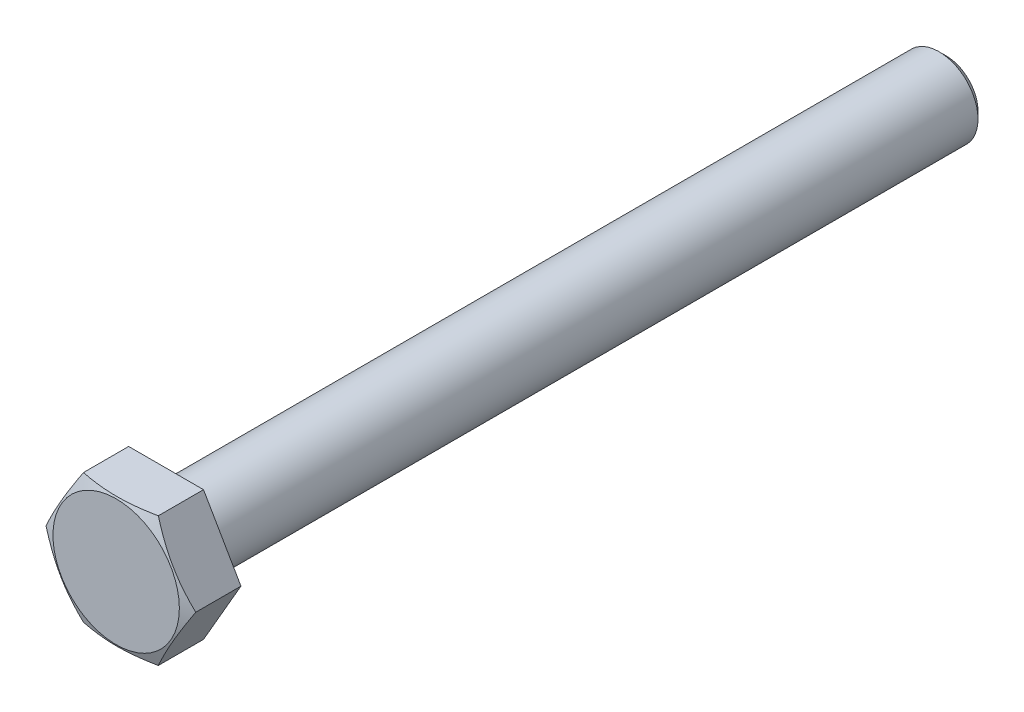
ISO-10303-21;
HEADER;
FILE_DESCRIPTION(('STEP AP214'),'2;1');
FILE_NAME('part.step','',(''),(''),'','','');
FILE_SCHEMA(('AUTOMOTIVE_DESIGN { 1 0 10303 214 1 1 1 1 }'));
ENDSEC;
DATA;
#1=APPLICATION_CONTEXT('core data for automotive mechanical design processes');
#2=APPLICATION_PROTOCOL_DEFINITION('international standard','automotive_design',2000,#1);
#3=PRODUCT_CONTEXT('',#1,'mechanical');
#4=PRODUCT('Part','Part','',(#3));
#5=PRODUCT_RELATED_PRODUCT_CATEGORY('part','',(#4));
#6=PRODUCT_DEFINITION_FORMATION('','',#4);
#7=PRODUCT_DEFINITION_CONTEXT('part definition',#1,'design');
#8=PRODUCT_DEFINITION('design','',#6,#7);
#9=PRODUCT_DEFINITION_SHAPE('','',#8);
#10=(LENGTH_UNIT() NAMED_UNIT(*) SI_UNIT(.MILLI.,.METRE.));
#11=(NAMED_UNIT(*) PLANE_ANGLE_UNIT() SI_UNIT($,.RADIAN.));
#12=(NAMED_UNIT(*) SI_UNIT($,.STERADIAN.) SOLID_ANGLE_UNIT());
#13=UNCERTAINTY_MEASURE_WITH_UNIT(LENGTH_MEASURE(1.E-05),#10,'distance_accuracy_value','');
#14=(GEOMETRIC_REPRESENTATION_CONTEXT(3) GLOBAL_UNCERTAINTY_ASSIGNED_CONTEXT((#13)) GLOBAL_UNIT_ASSIGNED_CONTEXT((#10,
#11,#12)) REPRESENTATION_CONTEXT('',''));
#15=CARTESIAN_POINT('',(0.,0.,0.));
#16=DIRECTION('',(0.,0.,1.));
#17=DIRECTION('',(1.,0.,0.));
#18=AXIS2_PLACEMENT_3D('',#15,#16,#17);
#19=CARTESIAN_POINT('',(0.,4.6,0.15));
#20=DIRECTION('',(0.,0.,1.));
#21=DIRECTION('',(1.,0.,0.));
#22=AXIS2_PLACEMENT_3D('',#19,#20,#21);
#23=PLANE('',#22);
#24=CARTESIAN_POINT('',(0.,0.,0.15));
#25=DIRECTION('',(0.,0.,1.));
#26=DIRECTION('',(1.,0.,0.));
#27=AXIS2_PLACEMENT_3D('',#24,#25,#26);
#28=CIRCLE('',#27,4.6);
#29=CARTESIAN_POINT('',(4.6,0.,0.15));
#30=VERTEX_POINT('',#29);
#31=EDGE_CURVE('E237',#30,#30,#28,.T.);
#32=ORIENTED_EDGE('',*,*,#31,.T.);
#33=EDGE_LOOP('',(#32));
#34=FACE_BOUND('',#33,.T.);
#35=DIRECTION('',(-1.,0.,0.));
#36=VECTOR('',#35,1.);
#37=CARTESIAN_POINT('',(0.,-4.99999766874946,0.15));
#38=LINE('',#37,#36);
#39=CARTESIAN_POINT('',(2.88675,-4.99999766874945,0.149999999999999));
#40=VERTEX_POINT('',#39);
#41=CARTESIAN_POINT('',(-2.88675,-4.99999766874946,0.15));
#42=VERTEX_POINT('',#41);
#43=EDGE_CURVE('E223',#40,#42,#38,.T.);
#44=ORIENTED_EDGE('',*,*,#43,.T.);
#45=DIRECTION('',(-0.5,0.866025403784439,0.));
#46=VECTOR('',#45,1.);
#47=CARTESIAN_POINT('',(-6.32198342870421,0.950001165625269,0.15));
#48=LINE('',#47,#46);
#49=CARTESIAN_POINT('',(-5.7735,0.,0.149999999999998));
#50=VERTEX_POINT('',#49);
#51=EDGE_CURVE('E100',#42,#50,#48,.T.);
#52=ORIENTED_EDGE('',*,*,#51,.T.);
#53=DIRECTION('',(0.5,0.866025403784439,0.));
#54=VECTOR('',#53,1.);
#55=CARTESIAN_POINT('',(-2.33826657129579,5.94999883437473,0.15));
#56=LINE('',#55,#54);
#57=CARTESIAN_POINT('',(-2.88675,4.99999766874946,0.149999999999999));
#58=VERTEX_POINT('',#57);
#59=EDGE_CURVE('E231',#50,#58,#56,.T.);
#60=ORIENTED_EDGE('',*,*,#59,.T.);
#61=DIRECTION('',(1.,0.,0.));
#62=VECTOR('',#61,1.);
#63=CARTESIAN_POINT('',(0.,4.99999766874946,0.15));
#64=LINE('',#63,#62);
#65=CARTESIAN_POINT('',(2.88675,4.99999766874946,0.149999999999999));
#66=VERTEX_POINT('',#65);
#67=EDGE_CURVE('E228',#58,#66,#64,.T.);
#68=ORIENTED_EDGE('',*,*,#67,.T.);
#69=DIRECTION('',(0.5,-0.866025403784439,0.));
#70=VECTOR('',#69,1.);
#71=CARTESIAN_POINT('',(2.33826657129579,5.94999883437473,0.15));
#72=LINE('',#71,#70);
#73=CARTESIAN_POINT('',(5.7735,0.,0.15));
#74=VERTEX_POINT('',#73);
#75=EDGE_CURVE('E226',#66,#74,#72,.T.);
#76=ORIENTED_EDGE('',*,*,#75,.T.);
#77=DIRECTION('',(-0.5,-0.866025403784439,0.));
#78=VECTOR('',#77,1.);
#79=CARTESIAN_POINT('',(6.32198342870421,0.950001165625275,0.15));
#80=LINE('',#79,#78);
#81=EDGE_CURVE('E211',#74,#40,#80,.T.);
#82=ORIENTED_EDGE('',*,*,#81,.T.);
#83=EDGE_LOOP('',(#44,#52,#60,#68,#76,#82));
#84=FACE_BOUND('',#83,.T.);
#85=ADVANCED_FACE('F32',(#34,#84),#23,.F.);
#86=CARTESIAN_POINT('',(0.,0.,4.));
#87=DIRECTION('',(0.,0.,1.));
#88=DIRECTION('',(1.,0.,0.));
#89=AXIS2_PLACEMENT_3D('',#86,#87,#88);
#90=CYLINDRICAL_SURFACE('',#89,3.);
#91=CARTESIAN_POINT('',(0.,0.,-0.3));
#92=DIRECTION('',(0.,0.,1.));
#93=DIRECTION('',(1.,0.,0.));
#94=AXIS2_PLACEMENT_3D('',#91,#92,#93);
#95=CIRCLE('',#94,3.);
#96=CARTESIAN_POINT('',(3.,0.,-0.3));
#97=VERTEX_POINT('',#96);
#98=EDGE_CURVE('E182',#97,#97,#95,.T.);
#99=ORIENTED_EDGE('',*,*,#98,.F.);
#100=EDGE_LOOP('',(#99));
#101=FACE_BOUND('',#100,.T.);
#102=CARTESIAN_POINT('',(0.,0.,-59.45875));
#103=DIRECTION('',(0.,0.,1.));
#104=DIRECTION('',(1.,0.,0.));
#105=AXIS2_PLACEMENT_3D('',#102,#103,#104);
#106=CIRCLE('',#105,3.);
#107=CARTESIAN_POINT('',(3.,0.,-59.45875));
#108=VERTEX_POINT('',#107);
#109=EDGE_CURVE('E178',#108,#108,#106,.T.);
#110=ORIENTED_EDGE('',*,*,#109,.T.);
#111=EDGE_LOOP('',(#110));
#112=FACE_BOUND('',#111,.T.);
#113=ADVANCED_FACE('F148',(#101,#112),#90,.T.);
#114=CARTESIAN_POINT('',(0.,0.,-0.3));
#115=DIRECTION('',(0.,0.,1.));
#116=DIRECTION('',(1.,0.,0.));
#117=AXIS2_PLACEMENT_3D('',#114,#115,#116);
#118=TOROIDAL_SURFACE('',#117,3.3,0.3);
#119=ORIENTED_EDGE('',*,*,#98,.T.);
#120=EDGE_LOOP('',(#119));
#121=FACE_BOUND('',#120,.T.);
#122=CARTESIAN_POINT('',(0.,0.,0.));
#123=DIRECTION('',(0.,0.,1.));
#124=DIRECTION('',(1.,0.,0.));
#125=AXIS2_PLACEMENT_3D('',#122,#123,#124);
#126=CIRCLE('',#125,3.3);
#127=CARTESIAN_POINT('',(3.3,0.,0.));
#128=VERTEX_POINT('',#127);
#129=EDGE_CURVE('E242',#128,#128,#126,.T.);
#130=ORIENTED_EDGE('',*,*,#129,.F.);
#131=EDGE_LOOP('',(#130));
#132=FACE_BOUND('',#131,.T.);
#133=ADVANCED_FACE('F153',(#121,#132),#118,.F.);
#134=CARTESIAN_POINT('',(0.,3.3,0.));
#135=DIRECTION('',(0.,0.,1.));
#136=DIRECTION('',(1.,0.,0.));
#137=AXIS2_PLACEMENT_3D('',#134,#135,#136);
#138=PLANE('',#137);
#139=CARTESIAN_POINT('',(0.,0.,0.));
#140=DIRECTION('',(0.,0.,1.));
#141=DIRECTION('',(1.,0.,0.));
#142=AXIS2_PLACEMENT_3D('',#139,#140,#141);
#143=CIRCLE('',#142,4.45);
#144=CARTESIAN_POINT('',(4.45,0.,0.));
#145=VERTEX_POINT('',#144);
#146=EDGE_CURVE('E239',#145,#145,#143,.T.);
#147=ORIENTED_EDGE('',*,*,#146,.F.);
#148=EDGE_LOOP('',(#147));
#149=FACE_BOUND('',#148,.T.);
#150=ORIENTED_EDGE('',*,*,#129,.T.);
#151=EDGE_LOOP('',(#150));
#152=FACE_BOUND('',#151,.T.);
#153=ADVANCED_FACE('F161',(#149,#152),#138,.F.);
#154=CARTESIAN_POINT('',(0.,0.,0.15));
#155=DIRECTION('',(0.,0.,1.));
#156=DIRECTION('',(1.,0.,0.));
#157=AXIS2_PLACEMENT_3D('',#154,#155,#156);
#158=TOROIDAL_SURFACE('',#157,4.45,0.15);
#159=ORIENTED_EDGE('',*,*,#31,.F.);
#160=EDGE_LOOP('',(#159));
#161=FACE_BOUND('',#160,.T.);
#162=ORIENTED_EDGE('',*,*,#146,.T.);
#163=EDGE_LOOP('',(#162));
#164=FACE_BOUND('',#163,.T.);
#165=ADVANCED_FACE('F135',(#161,#164),#158,.T.);
#166=CARTESIAN_POINT('',(-2.88675,-4.99999766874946,-60.));
#167=DIRECTION('',(0.866025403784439,0.5,0.));
#168=DIRECTION('',(0.5,-0.866025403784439,0.));
#169=AXIS2_PLACEMENT_3D('',#166,#167,#168);
#170=PLANE('',#169);
#171=ORIENTED_EDGE('',*,*,#51,.F.);
#172=DIRECTION('',(0.,0.,1.));
#173=VECTOR('',#172,1.);
#174=CARTESIAN_POINT('',(-2.88675,-4.99999766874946,-60.));
#175=LINE('',#174,#173);
#176=CARTESIAN_POINT('',(-2.88675,-4.99999766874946,3.63636363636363));
#177=VERTEX_POINT('',#176);
#178=EDGE_CURVE('E53',#42,#177,#175,.T.);
#179=ORIENTED_EDGE('',*,*,#178,.T.);
#180=CARTESIAN_POINT('',(-5.77350011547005,2.E-07,3.6363635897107));
#181=CARTESIAN_POINT('',(-5.67264486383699,-0.174686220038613,3.67711409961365));
#182=CARTESIAN_POINT('',(-5.57145672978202,-0.349949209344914,3.71479450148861));
#183=CARTESIAN_POINT('',(-5.36841136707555,-0.701634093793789,3.78285697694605));
#184=CARTESIAN_POINT('',(-5.26655378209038,-0.878056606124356,3.81323477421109));
#185=CARTESIAN_POINT('',(-5.06231450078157,-1.23180941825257,3.86547579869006));
#186=CARTESIAN_POINT('',(-4.95993296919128,-1.40913943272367,3.88734155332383));
#187=CARTESIAN_POINT('',(-4.75478960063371,-1.76445816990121,3.92154519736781));
#188=CARTESIAN_POINT('',(-4.65202785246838,-1.94244673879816,3.93388518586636));
#189=CARTESIAN_POINT('',(-4.44806875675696,-2.29571425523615,3.94826992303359));
#190=CARTESIAN_POINT('',(-4.34687447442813,-2.47098789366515,3.95048592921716));
#191=CARTESIAN_POINT('',(-4.14454571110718,-2.8214315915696,3.94496922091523));
#192=CARTESIAN_POINT('',(-4.04341123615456,-2.99660164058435,3.93723563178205));
#193=CARTESIAN_POINT('',(-3.8415075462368,-3.34630908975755,3.91223547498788));
#194=CARTESIAN_POINT('',(-3.74073814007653,-3.52084682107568,3.89497496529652));
#195=CARTESIAN_POINT('',(-3.53968045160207,-3.86908895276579,3.85175744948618));
#196=CARTESIAN_POINT('',(-3.43939212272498,-4.04279343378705,3.82580130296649));
#197=CARTESIAN_POINT('',(-3.30156801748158,-4.28151178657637,3.78477214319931));
#198=CARTESIAN_POINT('',(-3.26378112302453,-4.34696060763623,3.77296528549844));
#199=CARTESIAN_POINT('',(-3.18829651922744,-4.47770377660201,3.74832342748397));
#200=CARTESIAN_POINT('',(-3.15059879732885,-4.54299814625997,3.73548858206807));
#201=CARTESIAN_POINT('',(-3.0751603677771,-4.6736613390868,3.70880443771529));
#202=CARTESIAN_POINT('',(-3.03741995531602,-4.739029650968,3.69495181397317));
#203=CARTESIAN_POINT('',(-2.96202181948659,-4.86962305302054,3.66632988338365));
#204=CARTESIAN_POINT('',(-2.92436410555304,-4.93484812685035,3.65156047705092));
#205=CARTESIAN_POINT('',(-2.88674988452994,-4.99999786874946,3.6363635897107));
#206=B_SPLINE_CURVE_WITH_KNOTS('',3,(#180,#181,#182,#183,#184,#185,#186,#187,#188,#189,#190,
#191,#192,#193,#194,#195,#196,#197,#198,#199,#200,#201,#202,#203,#204,#205),.UNSPECIFIED.,.F.,
.F.,(4,2,2,2,2,2,2,2,2,2,2,2,4),(0.,0.617400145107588,1.23516095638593,1.85273820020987,
2.47017931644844,3.07713614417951,3.68414633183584,4.290770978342,4.89733567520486,
5.12680289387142,5.35623560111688,5.5864543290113,5.81669808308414),.UNSPECIFIED.);
#207=CARTESIAN_POINT('',(-5.7735,0.,3.63636363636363));
#208=VERTEX_POINT('',#207);
#209=EDGE_CURVE('E11',#208,#177,#206,.T.);
#210=ORIENTED_EDGE('',*,*,#209,.F.);
#211=DIRECTION('',(0.,0.,1.));
#212=VECTOR('',#211,1.);
#213=CARTESIAN_POINT('',(-5.7735,0.,-60.));
#214=LINE('',#213,#212);
#215=EDGE_CURVE('E221',#50,#208,#214,.T.);
#216=ORIENTED_EDGE('',*,*,#215,.F.);
#217=EDGE_LOOP('',(#171,#179,#210,#216));
#218=FACE_BOUND('',#217,.T.);
#219=ADVANCED_FACE('F96',(#218),#170,.F.);
#220=CARTESIAN_POINT('',(-5.7735,0.,-60.));
#221=DIRECTION('',(0.866025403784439,-0.5,0.));
#222=DIRECTION('',(-0.5,-0.866025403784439,0.));
#223=AXIS2_PLACEMENT_3D('',#220,#221,#222);
#224=PLANE('',#223);
#225=ORIENTED_EDGE('',*,*,#59,.F.);
#226=ORIENTED_EDGE('',*,*,#215,.T.);
#227=CARTESIAN_POINT('',(-2.88674988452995,4.99999786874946,3.6363635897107));
#228=CARTESIAN_POINT('',(-2.98760513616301,4.82531144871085,3.67711409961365));
#229=CARTESIAN_POINT('',(-3.08879327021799,4.65004845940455,3.71479450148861));
#230=CARTESIAN_POINT('',(-3.29183863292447,4.29836357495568,3.78285697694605));
#231=CARTESIAN_POINT('',(-3.39369621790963,4.12194106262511,3.81323477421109));
#232=CARTESIAN_POINT('',(-3.59793549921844,3.7681882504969,3.86547579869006));
#233=CARTESIAN_POINT('',(-3.70031703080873,3.59085823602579,3.88734155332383));
#234=CARTESIAN_POINT('',(-3.9054603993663,3.23553949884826,3.92154519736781));
#235=CARTESIAN_POINT('',(-4.00822214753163,3.05755092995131,3.93388518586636));
#236=CARTESIAN_POINT('',(-4.21218124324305,2.70428341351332,3.94826992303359));
#237=CARTESIAN_POINT('',(-4.31337552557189,2.52900977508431,3.95048592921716));
#238=CARTESIAN_POINT('',(-4.51570428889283,2.17856607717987,3.94496922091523));
#239=CARTESIAN_POINT('',(-4.61683876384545,2.00339602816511,3.93723563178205));
#240=CARTESIAN_POINT('',(-4.81874245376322,1.65368857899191,3.91223547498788));
#241=CARTESIAN_POINT('',(-4.91951185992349,1.47915084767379,3.89497496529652));
#242=CARTESIAN_POINT('',(-5.12056954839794,1.13090871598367,3.85175744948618));
#243=CARTESIAN_POINT('',(-5.220857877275,0.957204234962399,3.82580130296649));
#244=CARTESIAN_POINT('',(-5.35868198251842,0.71848588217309,3.78477214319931));
#245=CARTESIAN_POINT('',(-5.39646887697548,0.653037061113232,3.77296528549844));
#246=CARTESIAN_POINT('',(-5.47195348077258,0.522293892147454,3.74832342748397));
#247=CARTESIAN_POINT('',(-5.50965120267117,0.456999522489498,3.73548858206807));
#248=CARTESIAN_POINT('',(-5.58508963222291,0.326336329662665,3.70880443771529));
#249=CARTESIAN_POINT('',(-5.622830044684,0.260968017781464,3.69495181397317));
#250=CARTESIAN_POINT('',(-5.69822818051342,0.130374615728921,3.66632988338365));
#251=CARTESIAN_POINT('',(-5.73588589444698,0.065149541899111,3.65156047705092));
#252=CARTESIAN_POINT('',(-5.77350011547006,-1.999999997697E-07,3.6363635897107));
#253=B_SPLINE_CURVE_WITH_KNOTS('',3,(#227,#228,#229,#230,#231,#232,#233,#234,#235,#236,#237,
#238,#239,#240,#241,#242,#243,#244,#245,#246,#247,#248,#249,#250,#251,#252),.UNSPECIFIED.,.F.,
.F.,(4,2,2,2,2,2,2,2,2,2,2,2,4),(0.,0.617400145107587,1.23516095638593,1.85273820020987,
2.47017931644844,3.07713614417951,3.68414633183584,4.290770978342,4.89733567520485,
5.12680289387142,5.35623560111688,5.5864543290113,5.81669808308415),.UNSPECIFIED.);
#254=CARTESIAN_POINT('',(-2.88675,4.99999766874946,3.63636363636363));
#255=VERTEX_POINT('',#254);
#256=EDGE_CURVE('E46',#255,#208,#253,.T.);
#257=ORIENTED_EDGE('',*,*,#256,.F.);
#258=DIRECTION('',(0.,0.,1.));
#259=VECTOR('',#258,1.);
#260=CARTESIAN_POINT('',(-2.88675,4.99999766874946,-60.));
#261=LINE('',#260,#259);
#262=EDGE_CURVE('E216',#58,#255,#261,.T.);
#263=ORIENTED_EDGE('',*,*,#262,.F.);
#264=EDGE_LOOP('',(#225,#226,#257,#263));
#265=FACE_BOUND('',#264,.T.);
#266=ADVANCED_FACE('F127',(#265),#224,.F.);
#267=CARTESIAN_POINT('',(-2.88675,4.99999766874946,-60.));
#268=DIRECTION('',(0.,-1.,0.));
#269=DIRECTION('',(-1.,0.,0.));
#270=AXIS2_PLACEMENT_3D('',#267,#268,#269);
#271=PLANE('',#270);
#272=ORIENTED_EDGE('',*,*,#67,.F.);
#273=ORIENTED_EDGE('',*,*,#262,.T.);
#274=CARTESIAN_POINT('',(-7.6419002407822,4.99999766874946,2.27932670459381));
#275=CARTESIAN_POINT('',(-7.41625282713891,4.99999766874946,2.35559400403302));
#276=CARTESIAN_POINT('',(-7.19030588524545,4.99999766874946,2.43099140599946));
#277=CARTESIAN_POINT('',(-6.73765793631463,4.99999766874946,2.57956042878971));
#278=CARTESIAN_POINT('',(-6.51095685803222,4.99999766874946,2.65273183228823));
#279=CARTESIAN_POINT('',(-6.05614421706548,4.99999766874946,2.79652022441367));
#280=CARTESIAN_POINT('',(-5.82803057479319,4.99999766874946,2.86713065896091));
#281=CARTESIAN_POINT('',(-5.37077495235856,4.99999766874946,3.00493246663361));
#282=CARTESIAN_POINT('',(-5.14163299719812,4.99999766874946,3.07212392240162));
#283=CARTESIAN_POINT('',(-4.68508481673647,4.99999766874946,3.20139051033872));
#284=CARTESIAN_POINT('',(-4.45769414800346,4.99999766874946,3.26352031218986));
#285=CARTESIAN_POINT('',(-4.00153125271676,4.99999766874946,3.38254998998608));
#286=CARTESIAN_POINT('',(-3.77275898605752,4.99999766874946,3.43944971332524));
#287=CARTESIAN_POINT('',(-3.31379746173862,4.99999766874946,3.54666385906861));
#288=CARTESIAN_POINT('',(-3.08360906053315,4.99999766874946,3.59698191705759));
#289=CARTESIAN_POINT('',(-2.6215956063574,4.99999766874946,3.68948052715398));
#290=CARTESIAN_POINT('',(-2.3897706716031,4.99999766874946,3.73166166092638));
#291=CARTESIAN_POINT('',(-1.97207589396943,4.99999766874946,3.79851184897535));
#292=CARTESIAN_POINT('',(-1.786498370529,4.99999766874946,3.82499807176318));
#293=CARTESIAN_POINT('',(-1.41446692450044,4.99999766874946,3.87081997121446));
#294=CARTESIAN_POINT('',(-1.22801307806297,4.99999766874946,3.89015625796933));
#295=CARTESIAN_POINT('',(-0.854562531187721,4.99999766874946,3.92091583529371));
#296=CARTESIAN_POINT('',(-0.667566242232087,4.99999766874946,3.9323440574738));
#297=CARTESIAN_POINT('',(-0.293246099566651,4.99999766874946,3.94680745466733));
#298=CARTESIAN_POINT('',(-0.105922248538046,4.99999766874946,3.94984269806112));
#299=CARTESIAN_POINT('',(0.269576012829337,4.99999766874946,3.94737403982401));
#300=CARTESIAN_POINT('',(0.457750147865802,4.99999766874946,3.94182870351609));
#301=CARTESIAN_POINT('',(0.833662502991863,4.99999766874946,3.92237764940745));
#302=CARTESIAN_POINT('',(1.0214007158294,4.99999766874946,3.90847179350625));
#303=CARTESIAN_POINT('',(1.39625057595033,4.99999766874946,3.87288521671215));
#304=CARTESIAN_POINT('',(1.58336174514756,4.99999766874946,3.85119952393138));
#305=CARTESIAN_POINT('',(1.95663427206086,4.99999766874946,3.80087381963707));
#306=CARTESIAN_POINT('',(2.14279563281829,4.99999766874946,3.772233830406));
#307=CARTESIAN_POINT('',(2.54590440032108,4.99999766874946,3.70348011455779));
#308=CARTESIAN_POINT('',(2.76265863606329,4.99999766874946,3.66224113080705));
#309=CARTESIAN_POINT('',(3.19475033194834,4.99999766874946,3.5728938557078));
#310=CARTESIAN_POINT('',(3.4100876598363,4.99999766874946,3.52478493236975));
#311=CARTESIAN_POINT('',(3.83953716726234,4.99999766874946,3.4229455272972));
#312=CARTESIAN_POINT('',(4.05364865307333,4.99999766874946,3.36921214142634));
#313=CARTESIAN_POINT('',(4.48066714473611,4.99999766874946,3.2572138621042));
#314=CARTESIAN_POINT('',(4.69357419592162,4.99999766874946,3.19894914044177));
#315=CARTESIAN_POINT('',(5.1189104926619,4.99999766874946,3.0785943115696));
#316=CARTESIAN_POINT('',(5.33133696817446,4.99999766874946,3.01649445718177));
#317=CARTESIAN_POINT('',(5.75529184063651,4.99999766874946,2.88929917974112));
#318=CARTESIAN_POINT('',(5.96682022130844,4.99999766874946,2.82420370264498));
#319=CARTESIAN_POINT('',(6.60013824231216,4.99999766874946,2.62531997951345));
#320=CARTESIAN_POINT('',(7.02078576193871,4.99999766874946,2.48789831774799));
#321=CARTESIAN_POINT('',(7.85707218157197,4.99999766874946,2.20744332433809));
#322=CARTESIAN_POINT('',(8.27272578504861,4.99999766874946,2.06445340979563));
#323=CARTESIAN_POINT('',(9.10246362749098,4.99999766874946,1.7739007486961));
#324=CARTESIAN_POINT('',(9.51654774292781,4.99999766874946,1.62633765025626));
#325=CARTESIAN_POINT('',(10.340757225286,4.99999766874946,1.3289092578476));
#326=CARTESIAN_POINT('',(10.750890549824,4.99999766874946,1.17906595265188));
#327=CARTESIAN_POINT('',(11.3653909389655,4.99999766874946,0.952488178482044));
#328=CARTESIAN_POINT('',(11.5700948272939,4.99999766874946,0.876664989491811));
#329=CARTESIAN_POINT('',(11.9793035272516,4.99999766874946,0.724485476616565));
#330=CARTESIAN_POINT('',(12.1838083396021,4.99999766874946,0.648129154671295));
#331=CARTESIAN_POINT('',(12.3882270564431,4.99999766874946,0.571543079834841));
#332=B_SPLINE_CURVE_WITH_KNOTS('',3,(#274,#275,#276,#277,#278,#279,#280,#281,#282,#283,#284,
#285,#286,#287,#288,#289,#290,#291,#292,#293,#294,#295,#296,#297,#298,#299,#300,#301,#302,#303,
#304,#305,#306,#307,#308,#309,#310,#311,#312,#313,#314,#315,#316,#317,#318,#319,#320,#321,#322,
#323,#324,#325,#326,#327,#328,#329,#330,#331),.UNSPECIFIED.,.F.,.F.,(4,2,2,2,2,2,2,2,2,2,2,2,2,
2,2,2,2,2,2,2,2,2,2,2,2,2,2,2,4),(0.,0.714569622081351,1.42920878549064,2.14556357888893,
2.86190104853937,3.56902940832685,4.27617839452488,4.98293510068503,5.6896412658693,
6.2518960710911,6.81410288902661,7.37595878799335,7.93781010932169,8.50238302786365,
9.06696527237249,9.63190897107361,10.1968508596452,10.8586384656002,11.5204869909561,
12.1826789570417,12.8448458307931,13.5087710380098,14.1727082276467,15.5001923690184,
16.8188447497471,18.137598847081,19.4475358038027,20.1024211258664,20.757304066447),.UNSPECIFIED.);
#333=CARTESIAN_POINT('',(2.88675,4.99999766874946,3.63636363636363));
#334=VERTEX_POINT('',#333);
#335=EDGE_CURVE('E107',#334,#255,#332,.F.);
#336=ORIENTED_EDGE('',*,*,#335,.F.);
#337=DIRECTION('',(0.,0.,1.));
#338=VECTOR('',#337,1.);
#339=CARTESIAN_POINT('',(2.88675,4.99999766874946,-60.));
#340=LINE('',#339,#338);
#341=EDGE_CURVE('E213',#66,#334,#340,.T.);
#342=ORIENTED_EDGE('',*,*,#341,.F.);
#343=EDGE_LOOP('',(#272,#273,#336,#342));
#344=FACE_BOUND('',#343,.T.);
#345=ADVANCED_FACE('F130',(#344),#271,.F.);
#346=CARTESIAN_POINT('',(2.88675,4.99999766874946,-60.));
#347=DIRECTION('',(-0.866025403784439,-0.5,0.));
#348=DIRECTION('',(-0.5,0.866025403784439,0.));
#349=AXIS2_PLACEMENT_3D('',#346,#347,#348);
#350=PLANE('',#349);
#351=ORIENTED_EDGE('',*,*,#75,.F.);
#352=ORIENTED_EDGE('',*,*,#341,.T.);
#353=CARTESIAN_POINT('',(5.77350011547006,-2.00000000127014E-07,3.6363635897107));
#354=CARTESIAN_POINT('',(5.67264486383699,0.174686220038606,3.67711409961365));
#355=CARTESIAN_POINT('',(5.57145672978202,0.349949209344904,3.71479450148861));
#356=CARTESIAN_POINT('',(5.36841136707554,0.701634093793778,3.78285697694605));
#357=CARTESIAN_POINT('',(5.26655378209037,0.878056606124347,3.81323477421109));
#358=CARTESIAN_POINT('',(5.06231450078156,1.23180941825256,3.86547579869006));
#359=CARTESIAN_POINT('',(4.95993296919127,1.40913943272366,3.88734155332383));
#360=CARTESIAN_POINT('',(4.7547896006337,1.7644581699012,3.92154519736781));
#361=CARTESIAN_POINT('',(4.65202785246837,1.94244673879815,3.93388518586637));
#362=CARTESIAN_POINT('',(4.44806875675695,2.29571425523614,3.94826992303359));
#363=CARTESIAN_POINT('',(4.34687447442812,2.47098789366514,3.95048592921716));
#364=CARTESIAN_POINT('',(4.14454571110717,2.82143159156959,3.94496922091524));
#365=CARTESIAN_POINT('',(4.04341123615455,2.99660164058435,3.93723563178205));
#366=CARTESIAN_POINT('',(3.84150754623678,3.34630908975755,3.91223547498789));
#367=CARTESIAN_POINT('',(3.74073814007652,3.52084682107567,3.89497496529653));
#368=CARTESIAN_POINT('',(3.53968045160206,3.86908895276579,3.85175744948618));
#369=CARTESIAN_POINT('',(3.43939212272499,4.04279343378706,3.82580130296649));
#370=CARTESIAN_POINT('',(3.30156801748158,4.28151178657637,3.78477214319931));
#371=CARTESIAN_POINT('',(3.26378112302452,4.34696060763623,3.77296528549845));
#372=CARTESIAN_POINT('',(3.18829651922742,4.47770377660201,3.74832342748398));
#373=CARTESIAN_POINT('',(3.15059879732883,4.54299814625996,3.73548858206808));
#374=CARTESIAN_POINT('',(3.07516036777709,4.6736613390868,3.70880443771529));
#375=CARTESIAN_POINT('',(3.037419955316,4.739029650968,3.69495181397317));
#376=CARTESIAN_POINT('',(2.96202181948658,4.86962305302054,3.66632988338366));
#377=CARTESIAN_POINT('',(2.92436410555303,4.93484812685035,3.65156047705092));
#378=CARTESIAN_POINT('',(2.88674988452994,4.99999786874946,3.6363635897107));
#379=B_SPLINE_CURVE_WITH_KNOTS('',3,(#353,#354,#355,#356,#357,#358,#359,#360,#361,#362,#363,
#364,#365,#366,#367,#368,#369,#370,#371,#372,#373,#374,#375,#376,#377,#378),.UNSPECIFIED.,.F.,
.F.,(4,2,2,2,2,2,2,2,2,2,2,2,4),(0.,0.61740014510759,1.23516095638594,1.85273820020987,
2.47017931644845,3.07713614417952,3.68414633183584,4.29077097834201,4.89733567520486,
5.12680289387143,5.35623560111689,5.58645432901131,5.81669808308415),.UNSPECIFIED.);
#380=CARTESIAN_POINT('',(5.7735,0.,3.63636363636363));
#381=VERTEX_POINT('',#380);
#382=EDGE_CURVE('E111',#381,#334,#379,.T.);
#383=ORIENTED_EDGE('',*,*,#382,.F.);
#384=DIRECTION('',(0.,0.,1.));
#385=VECTOR('',#384,1.);
#386=CARTESIAN_POINT('',(5.7735,0.,-60.));
#387=LINE('',#386,#385);
#388=EDGE_CURVE('E210',#74,#381,#387,.T.);
#389=ORIENTED_EDGE('',*,*,#388,.F.);
#390=EDGE_LOOP('',(#351,#352,#383,#389));
#391=FACE_BOUND('',#390,.T.);
#392=ADVANCED_FACE('F198',(#391),#350,.F.);
#393=CARTESIAN_POINT('',(5.7735,0.,-60.));
#394=DIRECTION('',(-0.866025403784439,0.5,0.));
#395=DIRECTION('',(0.5,0.866025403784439,0.));
#396=AXIS2_PLACEMENT_3D('',#393,#394,#395);
#397=PLANE('',#396);
#398=ORIENTED_EDGE('',*,*,#81,.F.);
#399=ORIENTED_EDGE('',*,*,#388,.T.);
#400=CARTESIAN_POINT('',(2.88674988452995,-4.99999786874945,3.6363635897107));
#401=CARTESIAN_POINT('',(2.98760513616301,-4.82531144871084,3.67711409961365));
#402=CARTESIAN_POINT('',(3.08879327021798,-4.65004845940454,3.71479450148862));
#403=CARTESIAN_POINT('',(3.29183863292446,-4.29836357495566,3.78285697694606));
#404=CARTESIAN_POINT('',(3.39369621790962,-4.12194106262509,3.8132347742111));
#405=CARTESIAN_POINT('',(3.59793549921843,-3.76818825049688,3.86547579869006));
#406=CARTESIAN_POINT('',(3.70031703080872,-3.59085823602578,3.88734155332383));
#407=CARTESIAN_POINT('',(3.90546039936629,-3.23553949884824,3.92154519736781));
#408=CARTESIAN_POINT('',(4.00822214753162,-3.05755092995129,3.93388518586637));
#409=CARTESIAN_POINT('',(4.21218124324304,-2.70428341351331,3.94826992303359));
#410=CARTESIAN_POINT('',(4.31337552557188,-2.5290097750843,3.95048592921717));
#411=CARTESIAN_POINT('',(4.51570428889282,-2.17856607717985,3.94496922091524));
#412=CARTESIAN_POINT('',(4.61683876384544,-2.0033960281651,3.93723563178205));
#413=CARTESIAN_POINT('',(4.81874245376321,-1.6536885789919,3.91223547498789));
#414=CARTESIAN_POINT('',(4.91951185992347,-1.47915084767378,3.89497496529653));
#415=CARTESIAN_POINT('',(5.12056954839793,-1.13090871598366,3.85175744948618));
#416=CARTESIAN_POINT('',(5.22085787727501,-0.9572042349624,3.82580130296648));
#417=CARTESIAN_POINT('',(5.35868198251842,-0.718485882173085,3.78477214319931));
#418=CARTESIAN_POINT('',(5.39646887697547,-0.653037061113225,3.77296528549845));
#419=CARTESIAN_POINT('',(5.47195348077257,-0.522293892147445,3.74832342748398));
#420=CARTESIAN_POINT('',(5.50965120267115,-0.45699952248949,3.73548858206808));
#421=CARTESIAN_POINT('',(5.5850896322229,-0.326336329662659,3.7088044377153));
#422=CARTESIAN_POINT('',(5.62283004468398,-0.260968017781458,3.69495181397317));
#423=CARTESIAN_POINT('',(5.69822818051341,-0.130374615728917,3.66632988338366));
#424=CARTESIAN_POINT('',(5.73588589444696,-0.0651495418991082,3.65156047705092));
#425=CARTESIAN_POINT('',(5.77350011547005,1.99999999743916E-07,3.6363635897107));
#426=B_SPLINE_CURVE_WITH_KNOTS('',3,(#400,#401,#402,#403,#404,#405,#406,#407,#408,#409,#410,
#411,#412,#413,#414,#415,#416,#417,#418,#419,#420,#421,#422,#423,#424,#425),.UNSPECIFIED.,.F.,
.F.,(4,2,2,2,2,2,2,2,2,2,2,2,4),(0.,0.61740014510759,1.23516095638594,1.85273820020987,
2.47017931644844,3.07713614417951,3.68414633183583,4.290770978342,4.89733567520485,
5.12680289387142,5.35623560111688,5.58645432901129,5.81669808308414),.UNSPECIFIED.);
#427=CARTESIAN_POINT('',(2.88675,-4.99999766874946,3.63636363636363));
#428=VERTEX_POINT('',#427);
#429=EDGE_CURVE('E92',#428,#381,#426,.T.);
#430=ORIENTED_EDGE('',*,*,#429,.F.);
#431=DIRECTION('',(0.,0.,1.));
#432=VECTOR('',#431,1.);
#433=CARTESIAN_POINT('',(2.88675,-4.99999766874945,-60.));
#434=LINE('',#433,#432);
#435=EDGE_CURVE('E58',#40,#428,#434,.T.);
#436=ORIENTED_EDGE('',*,*,#435,.F.);
#437=EDGE_LOOP('',(#398,#399,#430,#436));
#438=FACE_BOUND('',#437,.T.);
#439=ADVANCED_FACE('F144',(#438),#397,.F.);
#440=CARTESIAN_POINT('',(2.88675,-4.99999766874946,-60.));
#441=DIRECTION('',(0.,1.,0.));
#442=DIRECTION('',(1.,0.,0.));
#443=AXIS2_PLACEMENT_3D('',#440,#441,#442);
#444=PLANE('',#443);
#445=ORIENTED_EDGE('',*,*,#43,.F.);
#446=ORIENTED_EDGE('',*,*,#435,.T.);
#447=CARTESIAN_POINT('',(-7.64190024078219,-4.99999766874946,2.27932670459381));
#448=CARTESIAN_POINT('',(-7.4162528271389,-4.99999766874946,2.35559400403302));
#449=CARTESIAN_POINT('',(-7.19030588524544,-4.99999766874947,2.43099140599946));
#450=CARTESIAN_POINT('',(-6.73765793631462,-4.99999766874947,2.57956042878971));
#451=CARTESIAN_POINT('',(-6.51095685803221,-4.99999766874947,2.65273183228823));
#452=CARTESIAN_POINT('',(-6.05614421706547,-4.99999766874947,2.79652022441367));
#453=CARTESIAN_POINT('',(-5.82803057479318,-4.99999766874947,2.86713065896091));
#454=CARTESIAN_POINT('',(-5.37077495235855,-4.99999766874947,3.00493246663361));
#455=CARTESIAN_POINT('',(-5.14163299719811,-4.99999766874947,3.07212392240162));
#456=CARTESIAN_POINT('',(-4.68508481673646,-4.99999766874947,3.20139051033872));
#457=CARTESIAN_POINT('',(-4.45769414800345,-4.99999766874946,3.26352031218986));
#458=CARTESIAN_POINT('',(-4.00153125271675,-4.99999766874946,3.38254998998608));
#459=CARTESIAN_POINT('',(-3.77275898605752,-4.99999766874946,3.43944971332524));
#460=CARTESIAN_POINT('',(-3.31379746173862,-4.99999766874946,3.54666385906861));
#461=CARTESIAN_POINT('',(-3.08360906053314,-4.99999766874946,3.59698191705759));
#462=CARTESIAN_POINT('',(-2.62159560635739,-4.99999766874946,3.68948052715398));
#463=CARTESIAN_POINT('',(-2.38977067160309,-4.99999766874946,3.73166166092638));
#464=CARTESIAN_POINT('',(-1.97207589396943,-4.99999766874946,3.79851184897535));
#465=CARTESIAN_POINT('',(-1.78649837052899,-4.99999766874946,3.82499807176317));
#466=CARTESIAN_POINT('',(-1.41446692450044,-4.99999766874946,3.87081997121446));
#467=CARTESIAN_POINT('',(-1.22801307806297,-4.99999766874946,3.89015625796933));
#468=CARTESIAN_POINT('',(-0.854562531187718,-4.99999766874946,3.9209158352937));
#469=CARTESIAN_POINT('',(-0.667566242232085,-4.99999766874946,3.9323440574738));
#470=CARTESIAN_POINT('',(-0.293246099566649,-4.99999766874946,3.94680745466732));
#471=CARTESIAN_POINT('',(-0.105922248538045,-4.99999766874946,3.94984269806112));
#472=CARTESIAN_POINT('',(0.269576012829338,-4.99999766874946,3.94737403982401));
#473=CARTESIAN_POINT('',(0.457750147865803,-4.99999766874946,3.94182870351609));
#474=CARTESIAN_POINT('',(0.833662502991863,-4.99999766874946,3.92237764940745));
#475=CARTESIAN_POINT('',(1.0214007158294,-4.99999766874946,3.90847179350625));
#476=CARTESIAN_POINT('',(1.39625057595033,-4.99999766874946,3.87288521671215));
#477=CARTESIAN_POINT('',(1.58336174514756,-4.99999766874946,3.85119952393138));
#478=CARTESIAN_POINT('',(1.95663427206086,-4.99999766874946,3.80087381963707));
#479=CARTESIAN_POINT('',(2.14279563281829,-4.99999766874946,3.772233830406));
#480=CARTESIAN_POINT('',(2.54590440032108,-4.99999766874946,3.70348011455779));
#481=CARTESIAN_POINT('',(2.76265863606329,-4.99999766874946,3.66224113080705));
#482=CARTESIAN_POINT('',(3.19475033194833,-4.99999766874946,3.5728938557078));
#483=CARTESIAN_POINT('',(3.4100876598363,-4.99999766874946,3.52478493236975));
#484=CARTESIAN_POINT('',(3.83953716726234,-4.99999766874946,3.42294552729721));
#485=CARTESIAN_POINT('',(4.05364865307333,-4.99999766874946,3.36921214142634));
#486=CARTESIAN_POINT('',(4.48066714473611,-4.99999766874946,3.2572138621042));
#487=CARTESIAN_POINT('',(4.69357419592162,-4.99999766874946,3.19894914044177));
#488=CARTESIAN_POINT('',(5.1189104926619,-4.99999766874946,3.0785943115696));
#489=CARTESIAN_POINT('',(5.33133696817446,-4.99999766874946,3.01649445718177));
#490=CARTESIAN_POINT('',(5.75529184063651,-4.99999766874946,2.88929917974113));
#491=CARTESIAN_POINT('',(5.96682022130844,-4.99999766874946,2.82420370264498));
#492=CARTESIAN_POINT('',(6.60013824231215,-4.99999766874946,2.62531997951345));
#493=CARTESIAN_POINT('',(7.02078576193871,-4.99999766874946,2.48789831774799));
#494=CARTESIAN_POINT('',(7.85707218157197,-4.99999766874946,2.20744332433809));
#495=CARTESIAN_POINT('',(8.27272578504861,-4.99999766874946,2.06445340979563));
#496=CARTESIAN_POINT('',(9.10246362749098,-4.99999766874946,1.7739007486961));
#497=CARTESIAN_POINT('',(9.51654774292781,-4.99999766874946,1.62633765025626));
#498=CARTESIAN_POINT('',(10.340757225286,-4.99999766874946,1.3289092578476));
#499=CARTESIAN_POINT('',(10.750890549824,-4.99999766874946,1.17906595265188));
#500=CARTESIAN_POINT('',(11.3653909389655,-4.99999766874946,0.952488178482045));
#501=CARTESIAN_POINT('',(11.5700948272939,-4.99999766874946,0.876664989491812));
#502=CARTESIAN_POINT('',(11.9793035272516,-4.99999766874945,0.724485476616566));
#503=CARTESIAN_POINT('',(12.1838083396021,-4.99999766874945,0.648129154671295));
#504=CARTESIAN_POINT('',(12.3882270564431,-4.99999766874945,0.57154307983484));
#505=B_SPLINE_CURVE_WITH_KNOTS('',3,(#447,#448,#449,#450,#451,#452,#453,#454,#455,#456,#457,
#458,#459,#460,#461,#462,#463,#464,#465,#466,#467,#468,#469,#470,#471,#472,#473,#474,#475,#476,
#477,#478,#479,#480,#481,#482,#483,#484,#485,#486,#487,#488,#489,#490,#491,#492,#493,#494,#495,
#496,#497,#498,#499,#500,#501,#502,#503,#504),.UNSPECIFIED.,.F.,.F.,(4,2,2,2,2,2,2,2,2,2,2,2,2,
2,2,2,2,2,2,2,2,2,2,2,2,2,2,2,4),(0.,0.714569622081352,1.42920878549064,2.14556357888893,
2.86190104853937,3.56902940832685,4.27617839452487,4.98293510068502,5.68964126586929,
6.2518960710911,6.8141028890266,7.37595878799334,7.93781010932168,8.50238302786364,
9.06696527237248,9.6319089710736,10.1968508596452,10.8586384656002,11.5204869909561,
12.1826789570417,12.8448458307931,13.5087710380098,14.1727082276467,15.5001923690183,
16.8188447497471,18.137598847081,19.4475358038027,20.1024211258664,20.757304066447),.UNSPECIFIED.);
#506=EDGE_CURVE('E88',#177,#428,#505,.T.);
#507=ORIENTED_EDGE('',*,*,#506,.F.);
#508=ORIENTED_EDGE('',*,*,#178,.F.);
#509=EDGE_LOOP('',(#445,#446,#507,#508));
#510=FACE_BOUND('',#509,.T.);
#511=ADVANCED_FACE('F89',(#510),#444,.F.);
#512=CARTESIAN_POINT('',(0.,4.87346841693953,4.));
#513=DIRECTION('',(0.,0.,-1.));
#514=DIRECTION('',(-1.,0.,0.));
#515=AXIS2_PLACEMENT_3D('',#512,#513,#514);
#516=PLANE('',#515);
#517=CARTESIAN_POINT('',(0.,0.,4.));
#518=DIRECTION('',(0.,0.,1.));
#519=DIRECTION('',(1.,0.,0.));
#520=AXIS2_PLACEMENT_3D('',#517,#518,#519);
#521=CIRCLE('',#520,4.87346841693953);
#522=CARTESIAN_POINT('',(4.87346841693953,0.,4.));
#523=VERTEX_POINT('',#522);
#524=EDGE_CURVE('E235',#523,#523,#521,.T.);
#525=ORIENTED_EDGE('',*,*,#524,.T.);
#526=EDGE_LOOP('',(#525));
#527=FACE_BOUND('',#526,.T.);
#528=ADVANCED_FACE('F136',(#527),#516,.F.);
#529=CARTESIAN_POINT('',(0.,0.,3.63636363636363));
#530=DIRECTION('',(0.,0.,-1.));
#531=DIRECTION('',(-1.,0.,0.));
#532=AXIS2_PLACEMENT_3D('',#529,#530,#531);
#533=CONICAL_SURFACE('',#532,5.7735,1.18682389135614);
#534=ORIENTED_EDGE('',*,*,#524,.F.);
#535=EDGE_LOOP('',(#534));
#536=FACE_BOUND('',#535,.T.);
#537=ORIENTED_EDGE('',*,*,#256,.T.);
#538=ORIENTED_EDGE('',*,*,#209,.T.);
#539=ORIENTED_EDGE('',*,*,#506,.T.);
#540=ORIENTED_EDGE('',*,*,#429,.T.);
#541=ORIENTED_EDGE('',*,*,#382,.T.);
#542=ORIENTED_EDGE('',*,*,#335,.T.);
#543=EDGE_LOOP('',(#537,#538,#539,#540,#541,#542));
#544=FACE_BOUND('',#543,.T.);
#545=ADVANCED_FACE('F104',(#536,#544),#533,.T.);
#546=CARTESIAN_POINT('',(0.,0.,-60.));
#547=DIRECTION('',(0.,0.,1.));
#548=DIRECTION('',(1.,0.,0.));
#549=AXIS2_PLACEMENT_3D('',#546,#547,#548);
#550=PLANE('',#549);
#551=CARTESIAN_POINT('',(0.,0.,-60.));
#552=DIRECTION('',(0.,0.,1.));
#553=DIRECTION('',(1.,0.,0.));
#554=AXIS2_PLACEMENT_3D('',#551,#552,#553);
#555=CIRCLE('',#554,2.45875);
#556=CARTESIAN_POINT('',(2.45875,0.,-60.));
#557=VERTEX_POINT('',#556);
#558=EDGE_CURVE('E93',#557,#557,#555,.T.);
#559=ORIENTED_EDGE('',*,*,#558,.F.);
#560=EDGE_LOOP('',(#559));
#561=FACE_BOUND('',#560,.T.);
#562=ADVANCED_FACE('F34',(#561),#550,.F.);
#563=CARTESIAN_POINT('',(0.,0.,-60.));
#564=DIRECTION('',(0.,0.,1.));
#565=DIRECTION('',(1.,0.,0.));
#566=AXIS2_PLACEMENT_3D('',#563,#564,#565);
#567=CONICAL_SURFACE('',#566,2.45875,0.78539816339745);
#568=ORIENTED_EDGE('',*,*,#109,.F.);
#569=EDGE_LOOP('',(#568));
#570=FACE_BOUND('',#569,.T.);
#571=ORIENTED_EDGE('',*,*,#558,.T.);
#572=EDGE_LOOP('',(#571));
#573=FACE_BOUND('',#572,.T.);
#574=ADVANCED_FACE('F168',(#570,#573),#567,.T.);
#575=CLOSED_SHELL('',(#85,#113,#133,#153,#165,#219,#266,#345,#392,#439,#511,#528,#545,#562,#574));
#576=MANIFOLD_SOLID_BREP('B2',#575);
#577=ADVANCED_BREP_SHAPE_REPRESENTATION('',(#18,#576),#14);
#578=SHAPE_DEFINITION_REPRESENTATION(#9,#577);
ENDSEC;
END-ISO-10303-21;
